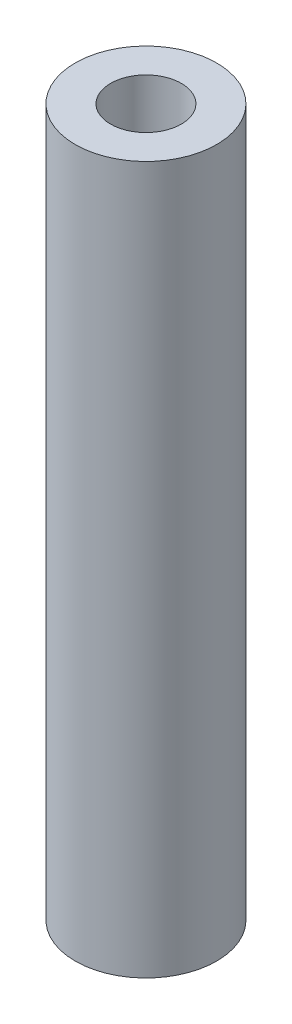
from build123d import *

# Parameters (mm, degrees)
SKETCH1_R           = 2.54
SKETCH1_R_2         = 1.27
BOSS_EXTRUDE1_DEPTH = 25.4


with BuildPart() as part:
    # Sketch1 → Boss-Extrude1 (new body)
    with BuildSketch(Plane(origin=(0, 0, 0), x_dir=(1, 0, 0), z_dir=(0, 1, 0))):
        with Locations(Location((0, 0, 0), (0, 0, 270))):
            Circle(SKETCH1_R)
        with Locations(Location((0, 0, 0), (0, 0, 270))):
            Circle(SKETCH1_R_2, mode=Mode.SUBTRACT)
    extrude(amount=BOSS_EXTRUDE1_DEPTH)


solid = part.part
